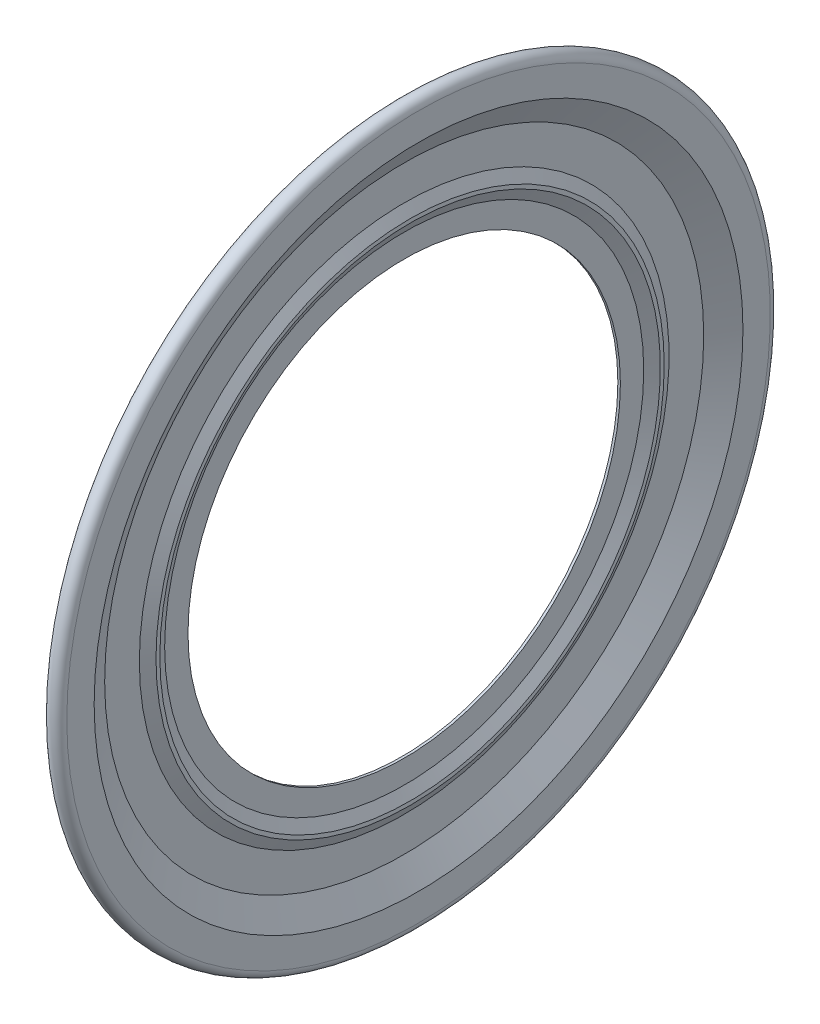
ISO-10303-21;
HEADER;
FILE_DESCRIPTION(('STEP AP214'),'2;1');
FILE_NAME('part.step','',(''),(''),'','','');
FILE_SCHEMA(('AUTOMOTIVE_DESIGN { 1 0 10303 214 1 1 1 1 }'));
ENDSEC;
DATA;
#1=APPLICATION_CONTEXT('core data for automotive mechanical design processes');
#2=APPLICATION_PROTOCOL_DEFINITION('international standard','automotive_design',2000,#1);
#3=PRODUCT_CONTEXT('',#1,'mechanical');
#4=PRODUCT('Part','Part','',(#3));
#5=PRODUCT_RELATED_PRODUCT_CATEGORY('part','',(#4));
#6=PRODUCT_DEFINITION_FORMATION('','',#4);
#7=PRODUCT_DEFINITION_CONTEXT('part definition',#1,'design');
#8=PRODUCT_DEFINITION('design','',#6,#7);
#9=PRODUCT_DEFINITION_SHAPE('','',#8);
#10=(LENGTH_UNIT() NAMED_UNIT(*) SI_UNIT(.MILLI.,.METRE.));
#11=(NAMED_UNIT(*) PLANE_ANGLE_UNIT() SI_UNIT($,.RADIAN.));
#12=(NAMED_UNIT(*) SI_UNIT($,.STERADIAN.) SOLID_ANGLE_UNIT());
#13=UNCERTAINTY_MEASURE_WITH_UNIT(LENGTH_MEASURE(1.E-05),#10,'distance_accuracy_value','');
#14=(GEOMETRIC_REPRESENTATION_CONTEXT(3) GLOBAL_UNCERTAINTY_ASSIGNED_CONTEXT((#13)) GLOBAL_UNIT_ASSIGNED_CONTEXT((#10,
#11,#12)) REPRESENTATION_CONTEXT('',''));
#15=CARTESIAN_POINT('',(0.,0.,0.));
#16=DIRECTION('',(0.,0.,1.));
#17=DIRECTION('',(1.,0.,0.));
#18=AXIS2_PLACEMENT_3D('',#15,#16,#17);
#19=CARTESIAN_POINT('',(0.166666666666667,0.,0.));
#20=DIRECTION('',(1.,0.,0.));
#21=DIRECTION('',(0.,0.,-1.));
#22=AXIS2_PLACEMENT_3D('',#19,#20,#21);
#23=CONICAL_SURFACE('',#22,11.8445436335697,1.0471975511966);
#24=CARTESIAN_POINT('',(0.733333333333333,0.,0.));
#25=DIRECTION('',(-1.,0.,0.));
#26=DIRECTION('',(0.,0.,1.));
#27=AXIS2_PLACEMENT_3D('',#24,#25,#26);
#28=CIRCLE('',#27,12.8260390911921);
#29=CARTESIAN_POINT('',(0.733333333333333,0.,12.8260390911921));
#30=VERTEX_POINT('',#29);
#31=EDGE_CURVE('E103',#30,#30,#28,.T.);
#32=ORIENTED_EDGE('',*,*,#31,.T.);
#33=EDGE_LOOP('',(#32));
#34=FACE_BOUND('',#33,.T.);
#35=CARTESIAN_POINT('',(0.166666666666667,0.,0.));
#36=DIRECTION('',(-1.,0.,0.));
#37=DIRECTION('',(0.,0.,1.));
#38=AXIS2_PLACEMENT_3D('',#35,#36,#37);
#39=CIRCLE('',#38,11.8445436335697);
#40=CARTESIAN_POINT('',(0.166666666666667,0.,11.8445436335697));
#41=VERTEX_POINT('',#40);
#42=EDGE_CURVE('E10',#41,#41,#39,.T.);
#43=ORIENTED_EDGE('',*,*,#42,.F.);
#44=EDGE_LOOP('',(#43));
#45=FACE_BOUND('',#44,.T.);
#46=ADVANCED_FACE('F14',(#34,#45),#23,.T.);
#47=CARTESIAN_POINT('',(0.166666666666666,10.4240048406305,0.));
#48=DIRECTION('',(-1.,0.,0.));
#49=DIRECTION('',(0.,0.,1.));
#50=AXIS2_PLACEMENT_3D('',#47,#48,#49);
#51=PLANE('',#50);
#52=ORIENTED_EDGE('',*,*,#42,.T.);
#53=EDGE_LOOP('',(#52));
#54=FACE_BOUND('',#53,.T.);
#55=CARTESIAN_POINT('',(0.166666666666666,0.,0.));
#56=DIRECTION('',(-1.,0.,0.));
#57=DIRECTION('',(0.,0.,1.));
#58=AXIS2_PLACEMENT_3D('',#55,#56,#57);
#59=CIRCLE('',#58,10.4240048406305);
#60=CARTESIAN_POINT('',(0.166666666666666,0.,10.4240048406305));
#61=VERTEX_POINT('',#60);
#62=EDGE_CURVE('E21',#61,#61,#59,.T.);
#63=ORIENTED_EDGE('',*,*,#62,.F.);
#64=EDGE_LOOP('',(#63));
#65=FACE_BOUND('',#64,.T.);
#66=ADVANCED_FACE('F124',(#54,#65),#51,.T.);
#67=CARTESIAN_POINT('',(0.4,0.,0.));
#68=DIRECTION('',(-1.,0.,0.));
#69=DIRECTION('',(0.,0.,1.));
#70=AXIS2_PLACEMENT_3D('',#67,#68,#69);
#71=CONICAL_SURFACE('',#70,10.0005540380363,1.06716405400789);
#72=ORIENTED_EDGE('',*,*,#62,.T.);
#73=EDGE_LOOP('',(#72));
#74=FACE_BOUND('',#73,.T.);
#75=CARTESIAN_POINT('',(0.4,0.,0.));
#76=DIRECTION('',(-1.,0.,0.));
#77=DIRECTION('',(0.,0.,1.));
#78=AXIS2_PLACEMENT_3D('',#75,#76,#77);
#79=CIRCLE('',#78,10.0005540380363);
#80=CARTESIAN_POINT('',(0.4,0.,10.0005540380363));
#81=VERTEX_POINT('',#80);
#82=EDGE_CURVE('E30',#81,#81,#79,.T.);
#83=ORIENTED_EDGE('',*,*,#82,.F.);
#84=EDGE_LOOP('',(#83));
#85=FACE_BOUND('',#84,.T.);
#86=ADVANCED_FACE('F128',(#74,#85),#71,.F.);
#87=CARTESIAN_POINT('',(0.4,9.90042978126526,0.));
#88=DIRECTION('',(-1.,0.,0.));
#89=DIRECTION('',(0.,0.,1.));
#90=AXIS2_PLACEMENT_3D('',#87,#88,#89);
#91=PLANE('',#90);
#92=ORIENTED_EDGE('',*,*,#82,.T.);
#93=EDGE_LOOP('',(#92));
#94=FACE_BOUND('',#93,.T.);
#95=CARTESIAN_POINT('',(0.4,0.,0.));
#96=DIRECTION('',(-1.,0.,0.));
#97=DIRECTION('',(0.,0.,1.));
#98=AXIS2_PLACEMENT_3D('',#95,#96,#97);
#99=CIRCLE('',#98,9.90042978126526);
#100=CARTESIAN_POINT('',(0.4,0.,9.90042978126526));
#101=VERTEX_POINT('',#100);
#102=EDGE_CURVE('E37',#101,#101,#99,.T.);
#103=ORIENTED_EDGE('',*,*,#102,.F.);
#104=EDGE_LOOP('',(#103));
#105=FACE_BOUND('',#104,.T.);
#106=ADVANCED_FACE('F132',(#94,#105),#91,.T.);
#107=CARTESIAN_POINT('',(0.166666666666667,0.,0.));
#108=DIRECTION('',(1.,0.,0.));
#109=DIRECTION('',(0.,0.,-1.));
#110=AXIS2_PLACEMENT_3D('',#107,#108,#109);
#111=CONICAL_SURFACE('',#110,9.47697897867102,1.06716405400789);
#112=ORIENTED_EDGE('',*,*,#102,.T.);
#113=EDGE_LOOP('',(#112));
#114=FACE_BOUND('',#113,.T.);
#115=CARTESIAN_POINT('',(0.166666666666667,0.,0.));
#116=DIRECTION('',(-1.,0.,0.));
#117=DIRECTION('',(0.,0.,1.));
#118=AXIS2_PLACEMENT_3D('',#115,#116,#117);
#119=CIRCLE('',#118,9.47697897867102);
#120=CARTESIAN_POINT('',(0.166666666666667,0.,9.47697897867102));
#121=VERTEX_POINT('',#120);
#122=EDGE_CURVE('E43',#121,#121,#119,.T.);
#123=ORIENTED_EDGE('',*,*,#122,.F.);
#124=EDGE_LOOP('',(#123));
#125=FACE_BOUND('',#124,.T.);
#126=ADVANCED_FACE('F138',(#114,#125),#111,.T.);
#127=CARTESIAN_POINT('',(0.166666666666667,8.52995311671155,0.));
#128=DIRECTION('',(-1.,0.,0.));
#129=DIRECTION('',(0.,0.,1.));
#130=AXIS2_PLACEMENT_3D('',#127,#128,#129);
#131=PLANE('',#130);
#132=ORIENTED_EDGE('',*,*,#122,.T.);
#133=EDGE_LOOP('',(#132));
#134=FACE_BOUND('',#133,.T.);
#135=CARTESIAN_POINT('',(0.166666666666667,0.,0.));
#136=DIRECTION('',(-1.,0.,0.));
#137=DIRECTION('',(0.,0.,1.));
#138=AXIS2_PLACEMENT_3D('',#135,#136,#137);
#139=CIRCLE('',#138,8.52995311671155);
#140=CARTESIAN_POINT('',(0.166666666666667,0.,8.52995311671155));
#141=VERTEX_POINT('',#140);
#142=EDGE_CURVE('E47',#141,#141,#139,.T.);
#143=ORIENTED_EDGE('',*,*,#142,.F.);
#144=EDGE_LOOP('',(#143));
#145=FACE_BOUND('',#144,.T.);
#146=ADVANCED_FACE('F142',(#134,#145),#131,.T.);
#147=CARTESIAN_POINT('',(0.,0.,0.));
#148=DIRECTION('',(-1.,0.,0.));
#149=DIRECTION('',(0.,0.,1.));
#150=AXIS2_PLACEMENT_3D('',#147,#148,#149);
#151=CYLINDRICAL_SURFACE('',#150,8.52995311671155);
#152=ORIENTED_EDGE('',*,*,#142,.T.);
#153=EDGE_LOOP('',(#152));
#154=FACE_BOUND('',#153,.T.);
#155=CARTESIAN_POINT('',(0.266666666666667,0.,0.));
#156=DIRECTION('',(-1.,0.,0.));
#157=DIRECTION('',(0.,0.,1.));
#158=AXIS2_PLACEMENT_3D('',#155,#156,#157);
#159=CIRCLE('',#158,8.52995311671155);
#160=CARTESIAN_POINT('',(0.266666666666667,0.,8.52995311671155));
#161=VERTEX_POINT('',#160);
#162=EDGE_CURVE('E51',#161,#161,#159,.T.);
#163=ORIENTED_EDGE('',*,*,#162,.F.);
#164=EDGE_LOOP('',(#163));
#165=FACE_BOUND('',#164,.T.);
#166=ADVANCED_FACE('F146',(#154,#165),#151,.F.);
#167=CARTESIAN_POINT('',(0.266666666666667,9.45125124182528,0.));
#168=DIRECTION('',(1.,0.,0.));
#169=DIRECTION('',(0.,0.,-1.));
#170=AXIS2_PLACEMENT_3D('',#167,#168,#169);
#171=PLANE('',#170);
#172=ORIENTED_EDGE('',*,*,#162,.T.);
#173=EDGE_LOOP('',(#172));
#174=FACE_BOUND('',#173,.T.);
#175=CARTESIAN_POINT('',(0.266666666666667,0.,0.));
#176=DIRECTION('',(-1.,0.,0.));
#177=DIRECTION('',(0.,0.,1.));
#178=AXIS2_PLACEMENT_3D('',#175,#176,#177);
#179=CIRCLE('',#178,9.45125124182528);
#180=CARTESIAN_POINT('',(0.266666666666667,0.,9.45125124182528));
#181=VERTEX_POINT('',#180);
#182=EDGE_CURVE('E55',#181,#181,#179,.T.);
#183=ORIENTED_EDGE('',*,*,#182,.F.);
#184=EDGE_LOOP('',(#183));
#185=FACE_BOUND('',#184,.T.);
#186=ADVANCED_FACE('F150',(#174,#185),#171,.T.);
#187=CARTESIAN_POINT('',(0.5,0.,0.));
#188=DIRECTION('',(1.,0.,0.));
#189=DIRECTION('',(0.,0.,-1.));
#190=AXIS2_PLACEMENT_3D('',#187,#188,#189);
#191=CONICAL_SURFACE('',#190,9.87470204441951,1.06716405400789);
#192=ORIENTED_EDGE('',*,*,#182,.T.);
#193=EDGE_LOOP('',(#192));
#194=FACE_BOUND('',#193,.T.);
#195=CARTESIAN_POINT('',(0.5,0.,0.));
#196=DIRECTION('',(-1.,0.,0.));
#197=DIRECTION('',(0.,0.,1.));
#198=AXIS2_PLACEMENT_3D('',#195,#196,#197);
#199=CIRCLE('',#198,9.87470204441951);
#200=CARTESIAN_POINT('',(0.5,0.,9.87470204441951));
#201=VERTEX_POINT('',#200);
#202=EDGE_CURVE('E59',#201,#201,#199,.T.);
#203=ORIENTED_EDGE('',*,*,#202,.F.);
#204=EDGE_LOOP('',(#203));
#205=FACE_BOUND('',#204,.T.);
#206=ADVANCED_FACE('F154',(#194,#205),#191,.F.);
#207=CARTESIAN_POINT('',(0.5,10.026281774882,0.));
#208=DIRECTION('',(1.,0.,0.));
#209=DIRECTION('',(0.,0.,-1.));
#210=AXIS2_PLACEMENT_3D('',#207,#208,#209);
#211=PLANE('',#210);
#212=ORIENTED_EDGE('',*,*,#202,.T.);
#213=EDGE_LOOP('',(#212));
#214=FACE_BOUND('',#213,.T.);
#215=CARTESIAN_POINT('',(0.5,0.,0.));
#216=DIRECTION('',(-1.,0.,0.));
#217=DIRECTION('',(0.,0.,1.));
#218=AXIS2_PLACEMENT_3D('',#215,#216,#217);
#219=CIRCLE('',#218,10.026281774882);
#220=CARTESIAN_POINT('',(0.5,0.,10.026281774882));
#221=VERTEX_POINT('',#220);
#222=EDGE_CURVE('E63',#221,#221,#219,.T.);
#223=ORIENTED_EDGE('',*,*,#222,.F.);
#224=EDGE_LOOP('',(#223));
#225=FACE_BOUND('',#224,.T.);
#226=ADVANCED_FACE('F158',(#214,#225),#211,.T.);
#227=CARTESIAN_POINT('',(0.266666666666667,0.,0.));
#228=DIRECTION('',(-1.,0.,0.));
#229=DIRECTION('',(0.,0.,1.));
#230=AXIS2_PLACEMENT_3D('',#227,#228,#229);
#231=CONICAL_SURFACE('',#230,10.4497325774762,1.06716405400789);
#232=ORIENTED_EDGE('',*,*,#222,.T.);
#233=EDGE_LOOP('',(#232));
#234=FACE_BOUND('',#233,.T.);
#235=CARTESIAN_POINT('',(0.266666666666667,0.,0.));
#236=DIRECTION('',(-1.,0.,0.));
#237=DIRECTION('',(0.,0.,1.));
#238=AXIS2_PLACEMENT_3D('',#235,#236,#237);
#239=CIRCLE('',#238,10.4497325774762);
#240=CARTESIAN_POINT('',(0.266666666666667,0.,10.4497325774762));
#241=VERTEX_POINT('',#240);
#242=EDGE_CURVE('E67',#241,#241,#239,.T.);
#243=ORIENTED_EDGE('',*,*,#242,.F.);
#244=EDGE_LOOP('',(#243));
#245=FACE_BOUND('',#244,.T.);
#246=ADVANCED_FACE('F162',(#234,#245),#231,.T.);
#247=CARTESIAN_POINT('',(0.266666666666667,11.8177487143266,0.));
#248=DIRECTION('',(1.,0.,0.));
#249=DIRECTION('',(0.,0.,-1.));
#250=AXIS2_PLACEMENT_3D('',#247,#248,#249);
#251=PLANE('',#250);
#252=ORIENTED_EDGE('',*,*,#242,.T.);
#253=EDGE_LOOP('',(#252));
#254=FACE_BOUND('',#253,.T.);
#255=CARTESIAN_POINT('',(0.266666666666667,0.,0.));
#256=DIRECTION('',(-1.,0.,0.));
#257=DIRECTION('',(0.,0.,1.));
#258=AXIS2_PLACEMENT_3D('',#255,#256,#257);
#259=CIRCLE('',#258,11.8177487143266);
#260=CARTESIAN_POINT('',(0.266666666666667,0.,11.8177487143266));
#261=VERTEX_POINT('',#260);
#262=EDGE_CURVE('E71',#261,#261,#259,.T.);
#263=ORIENTED_EDGE('',*,*,#262,.F.);
#264=EDGE_LOOP('',(#263));
#265=FACE_BOUND('',#264,.T.);
#266=ADVANCED_FACE('F166',(#254,#265),#251,.T.);
#267=CARTESIAN_POINT('',(0.833333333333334,0.,0.));
#268=DIRECTION('',(1.,0.,0.));
#269=DIRECTION('',(0.,0.,-1.));
#270=AXIS2_PLACEMENT_3D('',#267,#268,#269);
#271=CONICAL_SURFACE('',#270,12.799244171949,1.0471975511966);
#272=ORIENTED_EDGE('',*,*,#262,.T.);
#273=EDGE_LOOP('',(#272));
#274=FACE_BOUND('',#273,.T.);
#275=CARTESIAN_POINT('',(0.833333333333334,0.,0.));
#276=DIRECTION('',(-1.,0.,0.));
#277=DIRECTION('',(0.,0.,1.));
#278=AXIS2_PLACEMENT_3D('',#275,#276,#277);
#279=CIRCLE('',#278,12.799244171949);
#280=CARTESIAN_POINT('',(0.833333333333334,0.,12.799244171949));
#281=VERTEX_POINT('',#280);
#282=EDGE_CURVE('E75',#281,#281,#279,.T.);
#283=ORIENTED_EDGE('',*,*,#282,.F.);
#284=EDGE_LOOP('',(#283));
#285=FACE_BOUND('',#284,.T.);
#286=ADVANCED_FACE('F170',(#274,#285),#271,.F.);
#287=CARTESIAN_POINT('',(0.833333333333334,13.8787749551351,0.));
#288=DIRECTION('',(1.,0.,0.));
#289=DIRECTION('',(0.,0.,-1.));
#290=AXIS2_PLACEMENT_3D('',#287,#288,#289);
#291=PLANE('',#290);
#292=ORIENTED_EDGE('',*,*,#282,.T.);
#293=EDGE_LOOP('',(#292));
#294=FACE_BOUND('',#293,.T.);
#295=CARTESIAN_POINT('',(0.833333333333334,0.,0.));
#296=DIRECTION('',(-1.,0.,0.));
#297=DIRECTION('',(0.,0.,1.));
#298=AXIS2_PLACEMENT_3D('',#295,#296,#297);
#299=CIRCLE('',#298,13.8787749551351);
#300=CARTESIAN_POINT('',(0.833333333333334,0.,13.8787749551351));
#301=VERTEX_POINT('',#300);
#302=EDGE_CURVE('E79',#301,#301,#299,.T.);
#303=ORIENTED_EDGE('',*,*,#302,.F.);
#304=EDGE_LOOP('',(#303));
#305=FACE_BOUND('',#304,.T.);
#306=ADVANCED_FACE('F174',(#294,#305),#291,.T.);
#307=CARTESIAN_POINT('',(0.5,0.,0.));
#308=DIRECTION('',(-1.,0.,0.));
#309=DIRECTION('',(0.,0.,1.));
#310=AXIS2_PLACEMENT_3D('',#307,#308,#309);
#311=TOROIDAL_SURFACE('',#310,13.8787749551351,0.333333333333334);
#312=CARTESIAN_POINT('',(0.166666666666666,0.,0.));
#313=DIRECTION('',(-1.,0.,0.));
#314=DIRECTION('',(0.,0.,1.));
#315=AXIS2_PLACEMENT_3D('',#312,#313,#314);
#316=CIRCLE('',#315,13.8787749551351);
#317=CARTESIAN_POINT('',(0.166666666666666,0.,13.8787749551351));
#318=VERTEX_POINT('',#317);
#319=EDGE_CURVE('E83',#318,#318,#316,.T.);
#320=ORIENTED_EDGE('',*,*,#319,.F.);
#321=EDGE_LOOP('',(#320));
#322=FACE_BOUND('',#321,.T.);
#323=ORIENTED_EDGE('',*,*,#302,.T.);
#324=EDGE_LOOP('',(#323));
#325=FACE_BOUND('',#324,.T.);
#326=ADVANCED_FACE('F178',(#322,#325),#311,.T.);
#327=CARTESIAN_POINT('',(0.166666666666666,13.8787749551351,0.));
#328=DIRECTION('',(1.,0.,0.));
#329=DIRECTION('',(0.,0.,-1.));
#330=AXIS2_PLACEMENT_3D('',#327,#328,#329);
#331=PLANE('',#330);
#332=CARTESIAN_POINT('',(0.166666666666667,0.,0.));
#333=DIRECTION('',(-1.,0.,0.));
#334=DIRECTION('',(0.,0.,1.));
#335=AXIS2_PLACEMENT_3D('',#332,#333,#334);
#336=CIRCLE('',#335,12.7915694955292);
#337=CARTESIAN_POINT('',(0.166666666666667,0.,12.7915694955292));
#338=VERTEX_POINT('',#337);
#339=EDGE_CURVE('E87',#338,#338,#336,.T.);
#340=ORIENTED_EDGE('',*,*,#339,.F.);
#341=EDGE_LOOP('',(#340));
#342=FACE_BOUND('',#341,.T.);
#343=ORIENTED_EDGE('',*,*,#319,.T.);
#344=EDGE_LOOP('',(#343));
#345=FACE_BOUND('',#344,.T.);
#346=ADVANCED_FACE('F182',(#342,#345),#331,.F.);
#347=CARTESIAN_POINT('',(0.,0.,0.));
#348=DIRECTION('',(-1.,0.,0.));
#349=DIRECTION('',(0.,0.,1.));
#350=AXIS2_PLACEMENT_3D('',#347,#348,#349);
#351=CYLINDRICAL_SURFACE('',#350,12.7915694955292);
#352=CARTESIAN_POINT('',(0.266666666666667,0.,0.));
#353=DIRECTION('',(-1.,0.,0.));
#354=DIRECTION('',(0.,0.,1.));
#355=AXIS2_PLACEMENT_3D('',#352,#353,#354);
#356=CIRCLE('',#355,12.7915694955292);
#357=CARTESIAN_POINT('',(0.266666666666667,0.,12.7915694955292));
#358=VERTEX_POINT('',#357);
#359=EDGE_CURVE('E91',#358,#358,#356,.T.);
#360=ORIENTED_EDGE('',*,*,#359,.F.);
#361=EDGE_LOOP('',(#360));
#362=FACE_BOUND('',#361,.T.);
#363=ORIENTED_EDGE('',*,*,#339,.T.);
#364=EDGE_LOOP('',(#363));
#365=FACE_BOUND('',#364,.T.);
#366=ADVANCED_FACE('F186',(#362,#365),#351,.F.);
#367=CARTESIAN_POINT('',(0.266666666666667,13.8787749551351,0.));
#368=DIRECTION('',(1.,0.,0.));
#369=DIRECTION('',(0.,0.,-1.));
#370=AXIS2_PLACEMENT_3D('',#367,#368,#369);
#371=PLANE('',#370);
#372=ORIENTED_EDGE('',*,*,#359,.T.);
#373=EDGE_LOOP('',(#372));
#374=FACE_BOUND('',#373,.T.);
#375=CARTESIAN_POINT('',(0.266666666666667,0.,0.));
#376=DIRECTION('',(-1.,0.,0.));
#377=DIRECTION('',(0.,0.,1.));
#378=AXIS2_PLACEMENT_3D('',#375,#376,#377);
#379=CIRCLE('',#378,13.8787749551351);
#380=CARTESIAN_POINT('',(0.266666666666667,0.,13.8787749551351));
#381=VERTEX_POINT('',#380);
#382=EDGE_CURVE('E95',#381,#381,#379,.T.);
#383=ORIENTED_EDGE('',*,*,#382,.F.);
#384=EDGE_LOOP('',(#383));
#385=FACE_BOUND('',#384,.T.);
#386=ADVANCED_FACE('F120',(#374,#385),#371,.T.);
#387=CARTESIAN_POINT('',(0.5,0.,0.));
#388=DIRECTION('',(-1.,0.,0.));
#389=DIRECTION('',(0.,0.,1.));
#390=AXIS2_PLACEMENT_3D('',#387,#388,#389);
#391=TOROIDAL_SURFACE('',#390,13.8787749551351,0.233333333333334);
#392=ORIENTED_EDGE('',*,*,#382,.T.);
#393=EDGE_LOOP('',(#392));
#394=FACE_BOUND('',#393,.T.);
#395=CARTESIAN_POINT('',(0.733333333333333,0.,0.));
#396=DIRECTION('',(-1.,0.,0.));
#397=DIRECTION('',(0.,0.,1.));
#398=AXIS2_PLACEMENT_3D('',#395,#396,#397);
#399=CIRCLE('',#398,13.8787749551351);
#400=CARTESIAN_POINT('',(0.733333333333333,0.,13.8787749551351));
#401=VERTEX_POINT('',#400);
#402=EDGE_CURVE('E99',#401,#401,#399,.T.);
#403=ORIENTED_EDGE('',*,*,#402,.F.);
#404=EDGE_LOOP('',(#403));
#405=FACE_BOUND('',#404,.T.);
#406=ADVANCED_FACE('F113',(#394,#405),#391,.F.);
#407=CARTESIAN_POINT('',(0.733333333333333,12.8260390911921,0.));
#408=DIRECTION('',(-1.,0.,0.));
#409=DIRECTION('',(0.,0.,1.));
#410=AXIS2_PLACEMENT_3D('',#407,#408,#409);
#411=PLANE('',#410);
#412=ORIENTED_EDGE('',*,*,#402,.T.);
#413=EDGE_LOOP('',(#412));
#414=FACE_BOUND('',#413,.T.);
#415=ORIENTED_EDGE('',*,*,#31,.F.);
#416=EDGE_LOOP('',(#415));
#417=FACE_BOUND('',#416,.T.);
#418=ADVANCED_FACE('F111',(#414,#417),#411,.T.);
#419=CLOSED_SHELL('',(#46,#66,#86,#106,#126,#146,#166,#186,#206,#226,#246,#266,#286,#306,#326,
#346,#366,#386,#406,#418));
#420=MANIFOLD_SOLID_BREP('B1',#419);
#421=ADVANCED_BREP_SHAPE_REPRESENTATION('',(#18,#420),#14);
#422=SHAPE_DEFINITION_REPRESENTATION(#9,#421);
ENDSEC;
END-ISO-10303-21;
